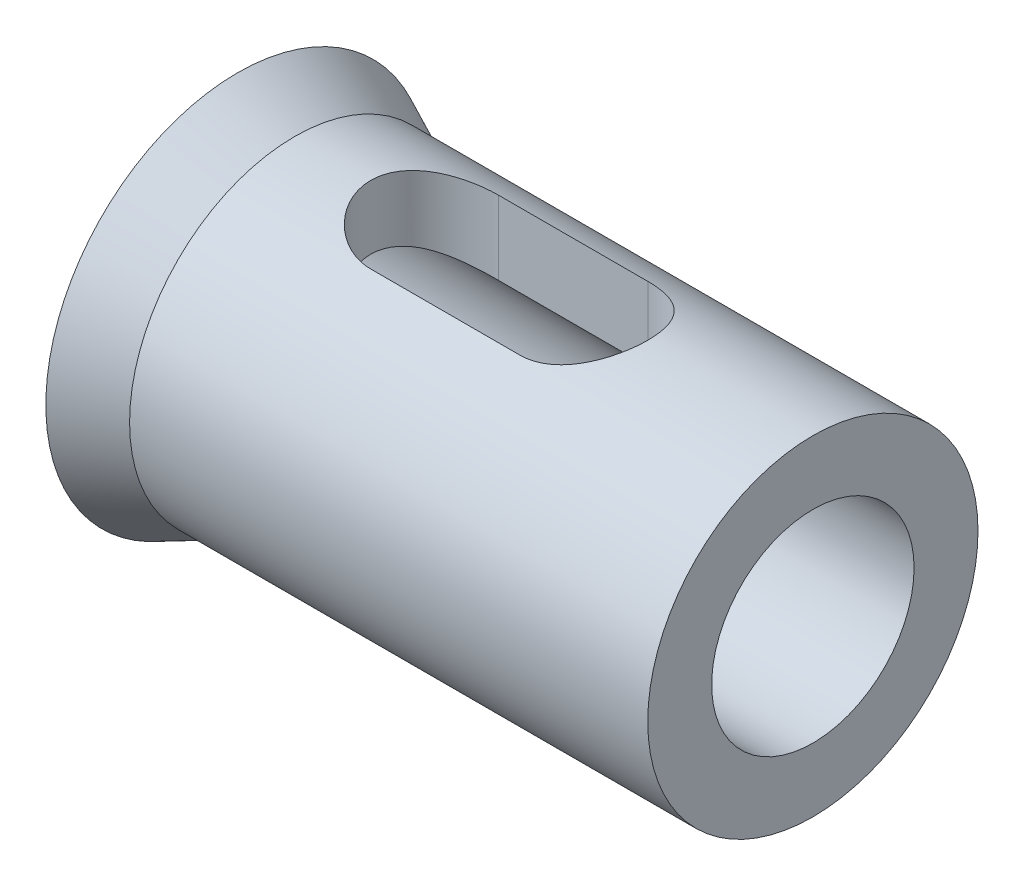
from build123d import *

# Parameters (mm, degrees)
F_9_5_9_5_PR_M_R_D_RY1_D      = 9.5
ODEBRAT_VYSUNUT_M1_DEPTH      = 30.849623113
ODEBRAT_VYSUNUT_M1_DEPTH_BACK = 30.849623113


with BuildPart() as part:
    # Skica1 → Rotovat1 (revolve)
    with BuildSketch(Plane.XY):
        Polygon((0, 0), (0, 9), (2.680633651, 7.75), (27, 7.75), (27, 0), align=None)
    revolve(axis=Axis((27, 0, 0), (-1, 0, 0)))

    # 9.5 _9.5_ pr_m_r d_ry1 (through all)
    with Locations(Plane(origin=(27, 0, 0), x_dir=(0, 0, -1), z_dir=(1, 0, 0))):
        with Locations((0, 0)):
            Hole(F_9_5_9_5_PR_M_R_D_RY1_D / 2)

    # Skica5 → Odebrat vysunut_m1 (cut, two sides: drawn at the far end of the back side and taken through both)
    with BuildSketch(Plane(origin=(0, 0, 0), x_dir=(1, 0, 0), z_dir=(0, 1, 0)).offset(-ODEBRAT_VYSUNUT_M1_DEPTH_BACK)):
        with BuildLine():
            Line((9.25, 3), (16.25, 3))
            ThreePointArc((16.25, 3), (19.25, 0), (16.25, -3))
            Line((16.25, -3), (9.25, -3))
            ThreePointArc((9.25, -3), (6.25, 0), (9.25, 3))
        make_face()
    extrude(amount=ODEBRAT_VYSUNUT_M1_DEPTH + ODEBRAT_VYSUNUT_M1_DEPTH_BACK, mode=Mode.SUBTRACT)


solid = part.part
